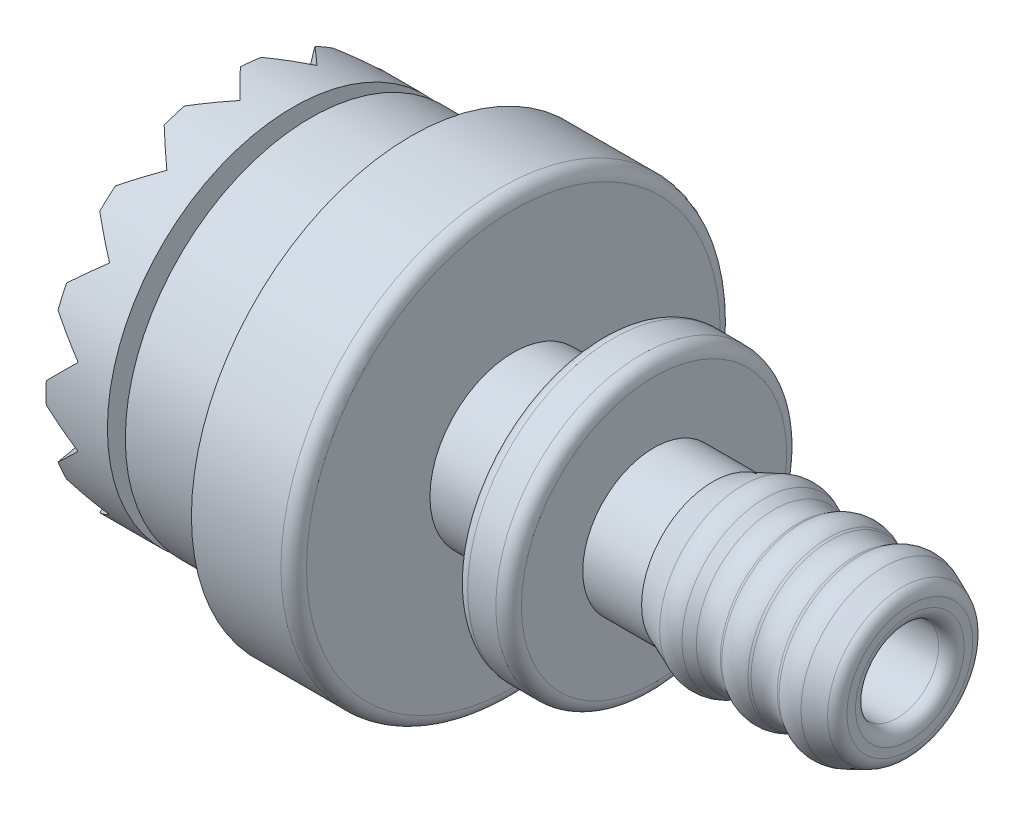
from build123d import *

# Parameters (mm, degrees)
EXTRUSION3_DEPTH             = 30.167016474
CONG_1_R                     = 0.5
R_P_TITION_CIRCULAIRE1_COUNT = 15


with BuildPart() as part:
    # Esquisse1 → R_volution1 (revolve)
    with BuildSketch(Plane.XY, mode=Mode.PRIVATE) as r_volution1_sk:
        with BuildLine():
            Line((0, 7.25), (0, 5.6))
            Line((0, 5.6), (1.558845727, 4.7))
            Line((1.558845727, 4.7), (6.5, 4.7))
            Line((6.5, 4.7), (8.275352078, 1.625))
            Line((8.275352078, 1.625), (26.52, 1.625))
            Line((26.52, 1.625), (26.52, 2.785))
            Line((26.52, 2.785), (25.495255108, 3.234658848))
            ThreePointArc((25.495255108, 3.234658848), (25.035300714, 3.317248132), (24.588042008, 3.181827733))
            Line((24.588042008, 3.181827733), (24.42168082, 3.08438978))
            ThreePointArc((24.42168082, 3.08438978), (23.911321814, 2.947290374), (23.402349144, 3.089450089))
            Line((23.402349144, 3.089450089), (23.326046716, 3.13516396))
            ThreePointArc((23.326046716, 3.13516396), (22.817074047, 3.277323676), (22.306715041, 3.14022427))
            Line((22.306715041, 3.14022427), (22.175252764, 3.063226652))
            ThreePointArc((22.175252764, 3.063226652), (21.696456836, 2.926468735), (21.211065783, 3.037571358))
            Line((21.211065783, 3.037571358), (20.841119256, 3.228590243))
            ThreePointArc((20.841119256, 3.228590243), (20.427845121, 3.339010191), (20.006241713, 3.266631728))
            Line((20.006241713, 3.266631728), (18.819615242, 2.785))
            Line((18.819615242, 2.785), (16.519615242, 2.785))
            Line((16.519615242, 2.785), (16.519615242, 5.685))
            Line((16.519615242, 5.685), (14.419615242, 5.685))
            Line((14.419615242, 5.685), (14.419615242, 3.26))
            Line((14.419615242, 3.26), (11.019615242, 3.26))
            Line((11.019615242, 3.26), (11.019615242, 8.585))
            Line((11.019615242, 8.585), (7.019615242, 8.585))
            Line((7.019615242, 8.585), (7.019615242, 7.25))
            Line((7.019615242, 7.25), (6.019615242, 7.25))
            Line((6.019615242, 7.25), (3.1, 7.25))
            Line((3.1, 7.25), (3.1, 5.85))
            Line((3.1, 5.85), (2.4, 5.85))
            Line((2.4, 5.85), (2.4, 7.25))
            Line((2.4, 7.25), (0, 7.25))
        make_face()
    revolve(r_volution1_sk.sketch.rotate(Axis((0, 0, 0), (1, 0, 0)), 90), axis=Axis((0, 0, 0), (1, 0, 0)))

    # Esquisse4 → Extrusion3 (cut, through all)
    with BuildSketch(Plane.XY):
        Polygon((0, -1.1), (1.1, 0), (0, 1.1), align=None)
    extrusion3 = extrude(amount=-EXTRUSION3_DEPTH, mode=Mode.SUBTRACT)

    # Cong_1
    cong_1_edges = [part.edges().sort_by_distance(p)[0] for p in [
        (11.019615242, 0, -8.585),
        (14.419615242, 0, -5.685),
        (16.519615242, 0, -5.685),
        (26.52, 0, -2.785),
        (26.52, 0, -1.625),
    ]]
    fillet(cong_1_edges, radius=CONG_1_R)

    # R_p_tition circulaire1: Extrusion3 ×15 about axis
    r_p_tition_circulaire1_axis = Axis((0, 0, 0), (1, 0, 0))
    for i in range(1, R_P_TITION_CIRCULAIRE1_COUNT):
        add(extrusion3.rotate(r_p_tition_circulaire1_axis, i * 360 / R_P_TITION_CIRCULAIRE1_COUNT), mode=Mode.SUBTRACT)


solid = part.part
